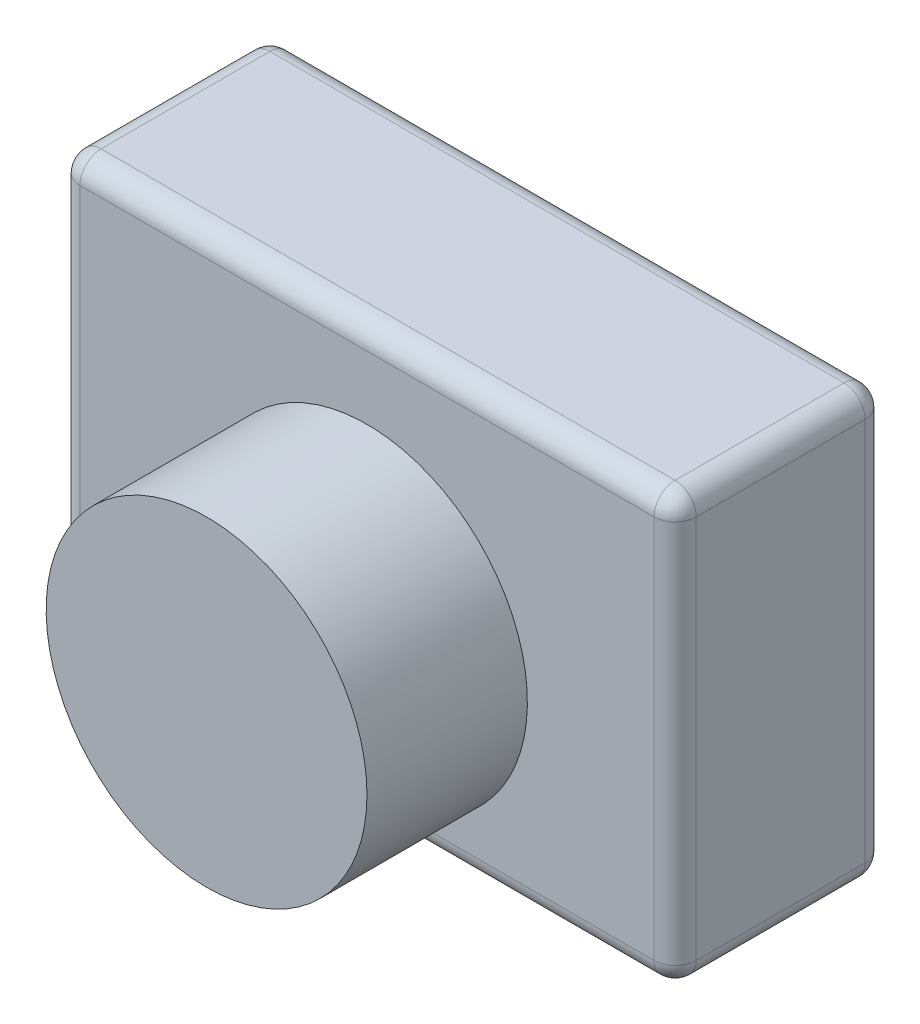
ISO-10303-21;
HEADER;
FILE_DESCRIPTION(('STEP AP214'),'2;1');
FILE_NAME('part.step','',(''),(''),'','','');
FILE_SCHEMA(('AUTOMOTIVE_DESIGN { 1 0 10303 214 1 1 1 1 }'));
ENDSEC;
DATA;
#1=APPLICATION_CONTEXT('core data for automotive mechanical design processes');
#2=APPLICATION_PROTOCOL_DEFINITION('international standard','automotive_design',2000,#1);
#3=PRODUCT_CONTEXT('',#1,'mechanical');
#4=PRODUCT('Part','Part','',(#3));
#5=PRODUCT_RELATED_PRODUCT_CATEGORY('part','',(#4));
#6=PRODUCT_DEFINITION_FORMATION('','',#4);
#7=PRODUCT_DEFINITION_CONTEXT('part definition',#1,'design');
#8=PRODUCT_DEFINITION('design','',#6,#7);
#9=PRODUCT_DEFINITION_SHAPE('','',#8);
#10=(LENGTH_UNIT() NAMED_UNIT(*) SI_UNIT(.MILLI.,.METRE.));
#11=(NAMED_UNIT(*) PLANE_ANGLE_UNIT() SI_UNIT($,.RADIAN.));
#12=(NAMED_UNIT(*) SI_UNIT($,.STERADIAN.) SOLID_ANGLE_UNIT());
#13=UNCERTAINTY_MEASURE_WITH_UNIT(LENGTH_MEASURE(1.E-05),#10,'distance_accuracy_value','');
#14=(GEOMETRIC_REPRESENTATION_CONTEXT(3) GLOBAL_UNCERTAINTY_ASSIGNED_CONTEXT((#13)) GLOBAL_UNIT_ASSIGNED_CONTEXT((#10,
#11,#12)) REPRESENTATION_CONTEXT('',''));
#15=CARTESIAN_POINT('',(0.,0.,0.));
#16=DIRECTION('',(0.,0.,1.));
#17=DIRECTION('',(1.,0.,0.));
#18=AXIS2_PLACEMENT_3D('',#15,#16,#17);
#19=CARTESIAN_POINT('',(-20.3950532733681,-82.7621158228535,50.));
#20=DIRECTION('',(0.,0.,1.));
#21=DIRECTION('',(1.,0.,0.));
#22=AXIS2_PLACEMENT_3D('',#19,#20,#21);
#23=PLANE('',#22);
#24=DIRECTION('',(1.,0.,0.));
#25=VECTOR('',#24,1.);
#26=CARTESIAN_POINT('',(125.604946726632,-77.7621158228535,50.));
#27=LINE('',#26,#25);
#28=CARTESIAN_POINT('',(-15.3950532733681,-77.7621158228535,50.));
#29=VERTEX_POINT('',#28);
#30=CARTESIAN_POINT('',(52.6049467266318,-77.7621158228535,50.));
#31=VERTEX_POINT('',#30);
#32=EDGE_CURVE('E157',#29,#31,#27,.T.);
#33=ORIENTED_EDGE('',*,*,#32,.T.);
#34=CARTESIAN_POINT('',(52.6049467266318,-39.7621158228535,50.));
#35=DIRECTION('',(0.,0.,1.));
#36=DIRECTION('',(1.,0.,0.));
#37=AXIS2_PLACEMENT_3D('',#34,#35,#36);
#38=CIRCLE('',#37,38.);
#39=EDGE_CURVE('E50',#31,#31,#38,.T.);
#40=ORIENTED_EDGE('',*,*,#39,.F.);
#41=CARTESIAN_POINT('',(120.604946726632,-77.7621158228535,50.));
#42=VERTEX_POINT('',#41);
#43=EDGE_CURVE('E161',#31,#42,#27,.T.);
#44=ORIENTED_EDGE('',*,*,#43,.T.);
#45=DIRECTION('',(0.,1.,0.));
#46=VECTOR('',#45,1.);
#47=CARTESIAN_POINT('',(120.604946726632,18.2378841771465,50.));
#48=LINE('',#47,#46);
#49=CARTESIAN_POINT('',(120.604946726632,13.2378841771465,50.));
#50=VERTEX_POINT('',#49);
#51=EDGE_CURVE('E163',#42,#50,#48,.T.);
#52=ORIENTED_EDGE('',*,*,#51,.T.);
#53=DIRECTION('',(-1.,0.,0.));
#54=VECTOR('',#53,1.);
#55=CARTESIAN_POINT('',(-20.3950532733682,13.2378841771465,50.));
#56=LINE('',#55,#54);
#57=CARTESIAN_POINT('',(-15.3950532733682,13.2378841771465,50.));
#58=VERTEX_POINT('',#57);
#59=EDGE_CURVE('E166',#50,#58,#56,.T.);
#60=ORIENTED_EDGE('',*,*,#59,.T.);
#61=DIRECTION('',(0.,-1.,0.));
#62=VECTOR('',#61,1.);
#63=CARTESIAN_POINT('',(-15.3950532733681,-82.7621158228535,50.));
#64=LINE('',#63,#62);
#65=EDGE_CURVE('E160',#58,#29,#64,.T.);
#66=ORIENTED_EDGE('',*,*,#65,.T.);
#67=EDGE_LOOP('',(#33,#40,#44,#52,#60,#66));
#68=FACE_BOUND('',#67,.T.);
#69=ADVANCED_FACE('F35',(#68),#23,.T.);
#70=CARTESIAN_POINT('',(-20.3950532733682,18.2378841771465,50.));
#71=DIRECTION('',(1.,0.,0.));
#72=DIRECTION('',(0.,1.,0.));
#73=AXIS2_PLACEMENT_3D('',#70,#71,#72);
#74=PLANE('',#73);
#75=DIRECTION('',(0.,0.,-1.));
#76=VECTOR('',#75,1.);
#77=CARTESIAN_POINT('',(-20.3950532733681,-77.7621158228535,50.));
#78=LINE('',#77,#76);
#79=CARTESIAN_POINT('',(-20.3950532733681,-77.7621158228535,5.));
#80=VERTEX_POINT('',#79);
#81=CARTESIAN_POINT('',(-20.3950532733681,-77.7621158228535,45.));
#82=VERTEX_POINT('',#81);
#83=EDGE_CURVE('E177',#80,#82,#78,.F.);
#84=ORIENTED_EDGE('',*,*,#83,.T.);
#85=DIRECTION('',(0.,-1.,0.));
#86=VECTOR('',#85,1.);
#87=CARTESIAN_POINT('',(-20.3950532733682,18.2378841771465,45.));
#88=LINE('',#87,#86);
#89=CARTESIAN_POINT('',(-20.3950532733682,13.2378841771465,45.));
#90=VERTEX_POINT('',#89);
#91=EDGE_CURVE('E183',#82,#90,#88,.F.);
#92=ORIENTED_EDGE('',*,*,#91,.T.);
#93=DIRECTION('',(0.,0.,-1.));
#94=VECTOR('',#93,1.);
#95=CARTESIAN_POINT('',(-20.3950532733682,13.2378841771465,50.));
#96=LINE('',#95,#94);
#97=CARTESIAN_POINT('',(-20.3950532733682,13.2378841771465,5.));
#98=VERTEX_POINT('',#97);
#99=EDGE_CURVE('E181',#90,#98,#96,.T.);
#100=ORIENTED_EDGE('',*,*,#99,.T.);
#101=DIRECTION('',(0.,-1.,0.));
#102=VECTOR('',#101,1.);
#103=CARTESIAN_POINT('',(-20.3950532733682,18.2378841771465,5.));
#104=LINE('',#103,#102);
#105=EDGE_CURVE('E179',#98,#80,#104,.T.);
#106=ORIENTED_EDGE('',*,*,#105,.T.);
#107=EDGE_LOOP('',(#84,#92,#100,#106));
#108=FACE_BOUND('',#107,.T.);
#109=ADVANCED_FACE('F320',(#108),#74,.F.);
#110=CARTESIAN_POINT('',(-20.3950532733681,-82.7621158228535,50.));
#111=DIRECTION('',(0.,1.,0.));
#112=DIRECTION('',(0.,0.,1.));
#113=AXIS2_PLACEMENT_3D('',#110,#111,#112);
#114=PLANE('',#113);
#115=CARTESIAN_POINT('',(24.,-82.7621158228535,25.));
#116=DIRECTION('',(0.,-1.,0.));
#117=DIRECTION('',(0.,0.,-1.));
#118=AXIS2_PLACEMENT_3D('',#115,#116,#117);
#119=CIRCLE('',#118,1.89864999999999);
#120=CARTESIAN_POINT('',(24.,-82.7621158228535,23.10135));
#121=VERTEX_POINT('',#120);
#122=EDGE_CURVE('E142',#121,#121,#119,.T.);
#123=ORIENTED_EDGE('',*,*,#122,.F.);
#124=EDGE_LOOP('',(#123));
#125=FACE_BOUND('',#124,.T.);
#126=CARTESIAN_POINT('',(74.,-82.7621158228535,25.));
#127=DIRECTION('',(0.,-1.,0.));
#128=DIRECTION('',(0.,0.,-1.));
#129=AXIS2_PLACEMENT_3D('',#126,#127,#128);
#130=CIRCLE('',#129,1.89864999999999);
#131=CARTESIAN_POINT('',(74.,-82.7621158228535,23.10135));
#132=VERTEX_POINT('',#131);
#133=EDGE_CURVE('E141',#132,#132,#130,.T.);
#134=ORIENTED_EDGE('',*,*,#133,.F.);
#135=EDGE_LOOP('',(#134));
#136=FACE_BOUND('',#135,.T.);
#137=DIRECTION('',(1.,0.,0.));
#138=VECTOR('',#137,1.);
#139=CARTESIAN_POINT('',(-20.3950532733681,-82.7621158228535,45.));
#140=LINE('',#139,#138);
#141=CARTESIAN_POINT('',(120.604946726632,-82.7621158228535,45.));
#142=VERTEX_POINT('',#141);
#143=CARTESIAN_POINT('',(-15.3950532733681,-82.7621158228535,45.));
#144=VERTEX_POINT('',#143);
#145=EDGE_CURVE('E44',#142,#144,#140,.F.);
#146=ORIENTED_EDGE('',*,*,#145,.T.);
#147=DIRECTION('',(0.,0.,-1.));
#148=VECTOR('',#147,1.);
#149=CARTESIAN_POINT('',(-15.3950532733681,-82.7621158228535,50.));
#150=LINE('',#149,#148);
#151=CARTESIAN_POINT('',(-15.3950532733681,-82.7621158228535,5.));
#152=VERTEX_POINT('',#151);
#153=EDGE_CURVE('E11',#144,#152,#150,.T.);
#154=ORIENTED_EDGE('',*,*,#153,.T.);
#155=DIRECTION('',(1.,0.,0.));
#156=VECTOR('',#155,1.);
#157=CARTESIAN_POINT('',(-20.3950532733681,-82.7621158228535,5.));
#158=LINE('',#157,#156);
#159=CARTESIAN_POINT('',(120.604946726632,-82.7621158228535,5.));
#160=VERTEX_POINT('',#159);
#161=EDGE_CURVE('E204',#152,#160,#158,.T.);
#162=ORIENTED_EDGE('',*,*,#161,.T.);
#163=DIRECTION('',(0.,0.,-1.));
#164=VECTOR('',#163,1.);
#165=CARTESIAN_POINT('',(120.604946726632,-82.7621158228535,50.));
#166=LINE('',#165,#164);
#167=EDGE_CURVE('E206',#160,#142,#166,.F.);
#168=ORIENTED_EDGE('',*,*,#167,.T.);
#169=EDGE_LOOP('',(#146,#154,#162,#168));
#170=FACE_BOUND('',#169,.T.);
#171=ADVANCED_FACE('F344',(#125,#136,#170),#114,.F.);
#172=CARTESIAN_POINT('',(125.604946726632,18.2378841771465,50.));
#173=DIRECTION('',(-1.,0.,0.));
#174=DIRECTION('',(0.,0.,1.));
#175=AXIS2_PLACEMENT_3D('',#172,#173,#174);
#176=PLANE('',#175);
#177=DIRECTION('',(0.,0.,-1.));
#178=VECTOR('',#177,1.);
#179=CARTESIAN_POINT('',(125.604946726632,13.2378841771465,50.));
#180=LINE('',#179,#178);
#181=CARTESIAN_POINT('',(125.604946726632,13.2378841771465,5.));
#182=VERTEX_POINT('',#181);
#183=CARTESIAN_POINT('',(125.604946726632,13.2378841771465,45.));
#184=VERTEX_POINT('',#183);
#185=EDGE_CURVE('E172',#182,#184,#180,.F.);
#186=ORIENTED_EDGE('',*,*,#185,.T.);
#187=DIRECTION('',(0.,1.,0.));
#188=VECTOR('',#187,1.);
#189=CARTESIAN_POINT('',(125.604946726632,-82.7621158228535,45.));
#190=LINE('',#189,#188);
#191=CARTESIAN_POINT('',(125.604946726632,-77.7621158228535,45.));
#192=VERTEX_POINT('',#191);
#193=EDGE_CURVE('E174',#184,#192,#190,.F.);
#194=ORIENTED_EDGE('',*,*,#193,.T.);
#195=DIRECTION('',(0.,0.,-1.));
#196=VECTOR('',#195,1.);
#197=CARTESIAN_POINT('',(125.604946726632,-77.7621158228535,50.));
#198=LINE('',#197,#196);
#199=CARTESIAN_POINT('',(125.604946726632,-77.7621158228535,5.));
#200=VERTEX_POINT('',#199);
#201=EDGE_CURVE('E168',#192,#200,#198,.T.);
#202=ORIENTED_EDGE('',*,*,#201,.T.);
#203=DIRECTION('',(0.,1.,0.));
#204=VECTOR('',#203,1.);
#205=CARTESIAN_POINT('',(125.604946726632,18.2378841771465,5.));
#206=LINE('',#205,#204);
#207=EDGE_CURVE('E170',#200,#182,#206,.T.);
#208=ORIENTED_EDGE('',*,*,#207,.T.);
#209=EDGE_LOOP('',(#186,#194,#202,#208));
#210=FACE_BOUND('',#209,.T.);
#211=ADVANCED_FACE('F357',(#210),#176,.F.);
#212=CARTESIAN_POINT('',(-20.3950532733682,18.2378841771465,50.));
#213=DIRECTION('',(0.,-1.,0.));
#214=DIRECTION('',(0.,0.,-1.));
#215=AXIS2_PLACEMENT_3D('',#212,#213,#214);
#216=PLANE('',#215);
#217=DIRECTION('',(-1.,0.,0.));
#218=VECTOR('',#217,1.);
#219=CARTESIAN_POINT('',(125.604946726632,18.2378841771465,45.));
#220=LINE('',#219,#218);
#221=CARTESIAN_POINT('',(-15.3950532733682,18.2378841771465,45.));
#222=VERTEX_POINT('',#221);
#223=CARTESIAN_POINT('',(120.604946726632,18.2378841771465,45.));
#224=VERTEX_POINT('',#223);
#225=EDGE_CURVE('E190',#222,#224,#220,.F.);
#226=ORIENTED_EDGE('',*,*,#225,.T.);
#227=DIRECTION('',(0.,0.,-1.));
#228=VECTOR('',#227,1.);
#229=CARTESIAN_POINT('',(120.604946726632,18.2378841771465,50.));
#230=LINE('',#229,#228);
#231=CARTESIAN_POINT('',(120.604946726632,18.2378841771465,5.));
#232=VERTEX_POINT('',#231);
#233=EDGE_CURVE('E192',#224,#232,#230,.T.);
#234=ORIENTED_EDGE('',*,*,#233,.T.);
#235=DIRECTION('',(-1.,0.,0.));
#236=VECTOR('',#235,1.);
#237=CARTESIAN_POINT('',(-20.3950532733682,18.2378841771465,5.));
#238=LINE('',#237,#236);
#239=CARTESIAN_POINT('',(-15.3950532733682,18.2378841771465,5.));
#240=VERTEX_POINT('',#239);
#241=EDGE_CURVE('E186',#232,#240,#238,.T.);
#242=ORIENTED_EDGE('',*,*,#241,.T.);
#243=DIRECTION('',(0.,0.,-1.));
#244=VECTOR('',#243,1.);
#245=CARTESIAN_POINT('',(-15.3950532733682,18.2378841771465,50.));
#246=LINE('',#245,#244);
#247=EDGE_CURVE('E188',#240,#222,#246,.F.);
#248=ORIENTED_EDGE('',*,*,#247,.T.);
#249=EDGE_LOOP('',(#226,#234,#242,#248));
#250=FACE_BOUND('',#249,.T.);
#251=ADVANCED_FACE('F353',(#250),#216,.F.);
#252=CARTESIAN_POINT('',(-20.3950532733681,-82.7621158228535,0.));
#253=DIRECTION('',(0.,0.,1.));
#254=DIRECTION('',(1.,0.,0.));
#255=AXIS2_PLACEMENT_3D('',#252,#253,#254);
#256=PLANE('',#255);
#257=DIRECTION('',(-1.,0.,0.));
#258=VECTOR('',#257,1.);
#259=CARTESIAN_POINT('',(-20.3950532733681,13.2378841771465,0.));
#260=LINE('',#259,#258);
#261=CARTESIAN_POINT('',(-15.3950532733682,13.2378841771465,0.));
#262=VERTEX_POINT('',#261);
#263=CARTESIAN_POINT('',(120.604946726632,13.2378841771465,0.));
#264=VERTEX_POINT('',#263);
#265=EDGE_CURVE('E199',#262,#264,#260,.F.);
#266=ORIENTED_EDGE('',*,*,#265,.T.);
#267=DIRECTION('',(0.,1.,0.));
#268=VECTOR('',#267,1.);
#269=CARTESIAN_POINT('',(120.604946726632,-82.7621158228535,0.));
#270=LINE('',#269,#268);
#271=CARTESIAN_POINT('',(120.604946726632,-77.7621158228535,0.));
#272=VERTEX_POINT('',#271);
#273=EDGE_CURVE('E201',#264,#272,#270,.F.);
#274=ORIENTED_EDGE('',*,*,#273,.T.);
#275=DIRECTION('',(1.,0.,0.));
#276=VECTOR('',#275,1.);
#277=CARTESIAN_POINT('',(-20.3950532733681,-77.7621158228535,0.));
#278=LINE('',#277,#276);
#279=CARTESIAN_POINT('',(-15.3950532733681,-77.7621158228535,0.));
#280=VERTEX_POINT('',#279);
#281=EDGE_CURVE('E195',#272,#280,#278,.F.);
#282=ORIENTED_EDGE('',*,*,#281,.T.);
#283=DIRECTION('',(0.,-1.,0.));
#284=VECTOR('',#283,1.);
#285=CARTESIAN_POINT('',(-15.3950532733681,-82.7621158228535,0.));
#286=LINE('',#285,#284);
#287=EDGE_CURVE('E197',#280,#262,#286,.F.);
#288=ORIENTED_EDGE('',*,*,#287,.T.);
#289=EDGE_LOOP('',(#266,#274,#282,#288));
#290=FACE_BOUND('',#289,.T.);
#291=ADVANCED_FACE('F350',(#290),#256,.F.);
#292=CARTESIAN_POINT('',(-15.3950532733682,18.2378841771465,5.));
#293=DIRECTION('',(0.,-1.,0.));
#294=DIRECTION('',(1.,0.,0.));
#295=AXIS2_PLACEMENT_3D('',#292,#293,#294);
#296=CYLINDRICAL_SURFACE('',#295,5.);
#297=CARTESIAN_POINT('',(-15.3950532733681,-77.7621158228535,5.));
#298=DIRECTION('',(0.,-1.,0.));
#299=DIRECTION('',(0.,0.,-1.));
#300=AXIS2_PLACEMENT_3D('',#297,#298,#299);
#301=CIRCLE('',#300,5.);
#302=EDGE_CURVE('E39',#80,#280,#301,.T.);
#303=ORIENTED_EDGE('',*,*,#302,.F.);
#304=ORIENTED_EDGE('',*,*,#105,.F.);
#305=CARTESIAN_POINT('',(-15.3950532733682,13.2378841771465,5.));
#306=DIRECTION('',(0.,1.,0.));
#307=DIRECTION('',(0.,0.,1.));
#308=AXIS2_PLACEMENT_3D('',#305,#306,#307);
#309=CIRCLE('',#308,5.);
#310=EDGE_CURVE('E268',#262,#98,#309,.T.);
#311=ORIENTED_EDGE('',*,*,#310,.F.);
#312=ORIENTED_EDGE('',*,*,#287,.F.);
#313=EDGE_LOOP('',(#303,#304,#311,#312));
#314=FACE_BOUND('',#313,.T.);
#315=ADVANCED_FACE('F37',(#314),#296,.T.);
#316=CARTESIAN_POINT('',(-15.3950532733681,-77.7621158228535,5.));
#317=DIRECTION('',(0.,0.,1.));
#318=DIRECTION('',(1.,0.,0.));
#319=AXIS2_PLACEMENT_3D('',#316,#317,#318);
#320=SPHERICAL_SURFACE('',#319,5.);
#321=CARTESIAN_POINT('',(-15.3950532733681,-77.7621158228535,5.));
#322=DIRECTION('',(0.,0.,-1.));
#323=DIRECTION('',(-1.,0.,0.));
#324=AXIS2_PLACEMENT_3D('',#321,#322,#323);
#325=CIRCLE('',#324,5.);
#326=EDGE_CURVE('E263',#80,#152,#325,.F.);
#327=ORIENTED_EDGE('',*,*,#326,.F.);
#328=ORIENTED_EDGE('',*,*,#302,.T.);
#329=CARTESIAN_POINT('',(-15.3950532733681,-77.7621158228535,5.));
#330=DIRECTION('',(-1.,0.,0.));
#331=DIRECTION('',(0.,0.,1.));
#332=AXIS2_PLACEMENT_3D('',#329,#330,#331);
#333=CIRCLE('',#332,5.);
#334=EDGE_CURVE('E266',#152,#280,#333,.F.);
#335=ORIENTED_EDGE('',*,*,#334,.F.);
#336=EDGE_LOOP('',(#327,#328,#335));
#337=FACE_BOUND('',#336,.T.);
#338=ADVANCED_FACE('F410',(#337),#320,.T.);
#339=CARTESIAN_POINT('',(-15.3950532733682,13.2378841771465,5.));
#340=DIRECTION('',(0.,0.,1.));
#341=DIRECTION('',(1.,0.,0.));
#342=AXIS2_PLACEMENT_3D('',#339,#340,#341);
#343=SPHERICAL_SURFACE('',#342,5.);
#344=CARTESIAN_POINT('',(-15.3950532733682,13.2378841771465,5.));
#345=DIRECTION('',(-1.,0.,0.));
#346=DIRECTION('',(0.,0.,1.));
#347=AXIS2_PLACEMENT_3D('',#344,#345,#346);
#348=CIRCLE('',#347,5.);
#349=EDGE_CURVE('E257',#262,#240,#348,.F.);
#350=ORIENTED_EDGE('',*,*,#349,.F.);
#351=ORIENTED_EDGE('',*,*,#310,.T.);
#352=CARTESIAN_POINT('',(-15.3950532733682,13.2378841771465,5.));
#353=DIRECTION('',(0.,0.,-1.));
#354=DIRECTION('',(-1.,0.,0.));
#355=AXIS2_PLACEMENT_3D('',#352,#353,#354);
#356=CIRCLE('',#355,5.);
#357=EDGE_CURVE('E260',#240,#98,#356,.F.);
#358=ORIENTED_EDGE('',*,*,#357,.F.);
#359=EDGE_LOOP('',(#350,#351,#358));
#360=FACE_BOUND('',#359,.T.);
#361=ADVANCED_FACE('F408',(#360),#343,.T.);
#362=CARTESIAN_POINT('',(-20.3950532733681,-77.7621158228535,5.));
#363=DIRECTION('',(1.,0.,0.));
#364=DIRECTION('',(0.,0.,-1.));
#365=AXIS2_PLACEMENT_3D('',#362,#363,#364);
#366=CYLINDRICAL_SURFACE('',#365,5.);
#367=ORIENTED_EDGE('',*,*,#334,.T.);
#368=ORIENTED_EDGE('',*,*,#281,.F.);
#369=CARTESIAN_POINT('',(120.604946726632,-77.7621158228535,5.));
#370=DIRECTION('',(1.,0.,0.));
#371=DIRECTION('',(0.,0.,-1.));
#372=AXIS2_PLACEMENT_3D('',#369,#370,#371);
#373=CIRCLE('',#372,5.);
#374=EDGE_CURVE('E252',#160,#272,#373,.T.);
#375=ORIENTED_EDGE('',*,*,#374,.F.);
#376=ORIENTED_EDGE('',*,*,#161,.F.);
#377=EDGE_LOOP('',(#367,#368,#375,#376));
#378=FACE_BOUND('',#377,.T.);
#379=ADVANCED_FACE('F405',(#378),#366,.T.);
#380=CARTESIAN_POINT('',(-15.3950532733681,-77.7621158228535,50.));
#381=DIRECTION('',(0.,0.,-1.));
#382=DIRECTION('',(-1.,0.,0.));
#383=AXIS2_PLACEMENT_3D('',#380,#381,#382);
#384=CYLINDRICAL_SURFACE('',#383,5.);
#385=ORIENTED_EDGE('',*,*,#326,.T.);
#386=ORIENTED_EDGE('',*,*,#153,.F.);
#387=CARTESIAN_POINT('',(-15.3950532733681,-77.7621158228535,45.));
#388=DIRECTION('',(0.,0.,1.));
#389=DIRECTION('',(1.,0.,0.));
#390=AXIS2_PLACEMENT_3D('',#387,#388,#389);
#391=CIRCLE('',#390,5.);
#392=EDGE_CURVE('E249',#82,#144,#391,.T.);
#393=ORIENTED_EDGE('',*,*,#392,.F.);
#394=ORIENTED_EDGE('',*,*,#83,.F.);
#395=EDGE_LOOP('',(#385,#386,#393,#394));
#396=FACE_BOUND('',#395,.T.);
#397=ADVANCED_FACE('F324',(#396),#384,.T.);
#398=CARTESIAN_POINT('',(-15.3950532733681,-82.7621158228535,45.));
#399=DIRECTION('',(0.,1.,0.));
#400=DIRECTION('',(-1.,0.,0.));
#401=AXIS2_PLACEMENT_3D('',#398,#399,#400);
#402=CYLINDRICAL_SURFACE('',#401,5.);
#403=CARTESIAN_POINT('',(-15.3950532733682,13.2378841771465,45.));
#404=DIRECTION('',(0.,1.,0.));
#405=DIRECTION('',(0.,0.,1.));
#406=AXIS2_PLACEMENT_3D('',#403,#404,#405);
#407=CIRCLE('',#406,5.);
#408=EDGE_CURVE('E243',#90,#58,#407,.T.);
#409=ORIENTED_EDGE('',*,*,#408,.F.);
#410=ORIENTED_EDGE('',*,*,#91,.F.);
#411=CARTESIAN_POINT('',(-15.3950532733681,-77.7621158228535,45.));
#412=DIRECTION('',(0.,-1.,0.));
#413=DIRECTION('',(0.,0.,-1.));
#414=AXIS2_PLACEMENT_3D('',#411,#412,#413);
#415=CIRCLE('',#414,5.);
#416=EDGE_CURVE('E246',#29,#82,#415,.T.);
#417=ORIENTED_EDGE('',*,*,#416,.F.);
#418=ORIENTED_EDGE('',*,*,#65,.F.);
#419=EDGE_LOOP('',(#409,#410,#417,#418));
#420=FACE_BOUND('',#419,.T.);
#421=ADVANCED_FACE('F308',(#420),#402,.T.);
#422=CARTESIAN_POINT('',(-15.3950532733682,13.2378841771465,50.));
#423=DIRECTION('',(0.,0.,-1.));
#424=DIRECTION('',(-1.,0.,0.));
#425=AXIS2_PLACEMENT_3D('',#422,#423,#424);
#426=CYLINDRICAL_SURFACE('',#425,5.);
#427=ORIENTED_EDGE('',*,*,#357,.T.);
#428=ORIENTED_EDGE('',*,*,#99,.F.);
#429=CARTESIAN_POINT('',(-15.3950532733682,13.2378841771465,45.));
#430=DIRECTION('',(0.,0.,1.));
#431=DIRECTION('',(1.,0.,0.));
#432=AXIS2_PLACEMENT_3D('',#429,#430,#431);
#433=CIRCLE('',#432,5.);
#434=EDGE_CURVE('E241',#222,#90,#433,.T.);
#435=ORIENTED_EDGE('',*,*,#434,.F.);
#436=ORIENTED_EDGE('',*,*,#247,.F.);
#437=EDGE_LOOP('',(#427,#428,#435,#436));
#438=FACE_BOUND('',#437,.T.);
#439=ADVANCED_FACE('F317',(#438),#426,.T.);
#440=CARTESIAN_POINT('',(-20.3950532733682,13.2378841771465,5.));
#441=DIRECTION('',(-1.,0.,0.));
#442=DIRECTION('',(0.,0.,1.));
#443=AXIS2_PLACEMENT_3D('',#440,#441,#442);
#444=CYLINDRICAL_SURFACE('',#443,5.);
#445=ORIENTED_EDGE('',*,*,#349,.T.);
#446=ORIENTED_EDGE('',*,*,#241,.F.);
#447=CARTESIAN_POINT('',(120.604946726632,13.2378841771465,5.));
#448=DIRECTION('',(1.,0.,0.));
#449=DIRECTION('',(0.,0.,-1.));
#450=AXIS2_PLACEMENT_3D('',#447,#448,#449);
#451=CIRCLE('',#450,5.);
#452=EDGE_CURVE('E238',#264,#232,#451,.T.);
#453=ORIENTED_EDGE('',*,*,#452,.F.);
#454=ORIENTED_EDGE('',*,*,#265,.F.);
#455=EDGE_LOOP('',(#445,#446,#453,#454));
#456=FACE_BOUND('',#455,.T.);
#457=ADVANCED_FACE('F399',(#456),#444,.T.);
#458=CARTESIAN_POINT('',(120.604946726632,18.2378841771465,5.));
#459=DIRECTION('',(0.,1.,0.));
#460=DIRECTION('',(0.,0.,1.));
#461=AXIS2_PLACEMENT_3D('',#458,#459,#460);
#462=CYLINDRICAL_SURFACE('',#461,5.);
#463=CARTESIAN_POINT('',(120.604946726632,-77.7621158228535,5.));
#464=DIRECTION('',(0.,-1.,0.));
#465=DIRECTION('',(0.,0.,-1.));
#466=AXIS2_PLACEMENT_3D('',#463,#464,#465);
#467=CIRCLE('',#466,5.);
#468=EDGE_CURVE('E254',#272,#200,#467,.T.);
#469=ORIENTED_EDGE('',*,*,#468,.F.);
#470=ORIENTED_EDGE('',*,*,#273,.F.);
#471=CARTESIAN_POINT('',(120.604946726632,13.2378841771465,5.));
#472=DIRECTION('',(0.,1.,0.));
#473=DIRECTION('',(0.,0.,1.));
#474=AXIS2_PLACEMENT_3D('',#471,#472,#473);
#475=CIRCLE('',#474,5.);
#476=EDGE_CURVE('E235',#182,#264,#475,.T.);
#477=ORIENTED_EDGE('',*,*,#476,.F.);
#478=ORIENTED_EDGE('',*,*,#207,.F.);
#479=EDGE_LOOP('',(#469,#470,#477,#478));
#480=FACE_BOUND('',#479,.T.);
#481=ADVANCED_FACE('F336',(#480),#462,.T.);
#482=CARTESIAN_POINT('',(120.604946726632,-77.7621158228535,5.));
#483=DIRECTION('',(0.,0.,1.));
#484=DIRECTION('',(1.,0.,0.));
#485=AXIS2_PLACEMENT_3D('',#482,#483,#484);
#486=SPHERICAL_SURFACE('',#485,5.);
#487=ORIENTED_EDGE('',*,*,#374,.T.);
#488=ORIENTED_EDGE('',*,*,#468,.T.);
#489=CARTESIAN_POINT('',(120.604946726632,-77.7621158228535,5.));
#490=DIRECTION('',(0.,0.,-1.));
#491=DIRECTION('',(-1.,0.,0.));
#492=AXIS2_PLACEMENT_3D('',#489,#490,#491);
#493=CIRCLE('',#492,5.);
#494=EDGE_CURVE('E232',#160,#200,#493,.F.);
#495=ORIENTED_EDGE('',*,*,#494,.F.);
#496=EDGE_LOOP('',(#487,#488,#495));
#497=FACE_BOUND('',#496,.T.);
#498=ADVANCED_FACE('F328',(#497),#486,.T.);
#499=CARTESIAN_POINT('',(-15.3950532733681,-77.7621158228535,45.));
#500=DIRECTION('',(0.,0.,1.));
#501=DIRECTION('',(1.,0.,0.));
#502=AXIS2_PLACEMENT_3D('',#499,#500,#501);
#503=SPHERICAL_SURFACE('',#502,5.);
#504=ORIENTED_EDGE('',*,*,#416,.T.);
#505=ORIENTED_EDGE('',*,*,#392,.T.);
#506=CARTESIAN_POINT('',(-15.3950532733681,-77.7621158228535,45.));
#507=DIRECTION('',(-1.,0.,0.));
#508=DIRECTION('',(0.,0.,1.));
#509=AXIS2_PLACEMENT_3D('',#506,#507,#508);
#510=CIRCLE('',#509,5.);
#511=EDGE_CURVE('E229',#29,#144,#510,.F.);
#512=ORIENTED_EDGE('',*,*,#511,.F.);
#513=EDGE_LOOP('',(#504,#505,#512));
#514=FACE_BOUND('',#513,.T.);
#515=ADVANCED_FACE('F326',(#514),#503,.T.);
#516=CARTESIAN_POINT('',(-15.3950532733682,13.2378841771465,45.));
#517=DIRECTION('',(0.,0.,1.));
#518=DIRECTION('',(1.,0.,0.));
#519=AXIS2_PLACEMENT_3D('',#516,#517,#518);
#520=SPHERICAL_SURFACE('',#519,5.);
#521=ORIENTED_EDGE('',*,*,#434,.T.);
#522=ORIENTED_EDGE('',*,*,#408,.T.);
#523=CARTESIAN_POINT('',(-15.3950532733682,13.2378841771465,45.));
#524=DIRECTION('',(-1.,0.,0.));
#525=DIRECTION('',(0.,0.,1.));
#526=AXIS2_PLACEMENT_3D('',#523,#524,#525);
#527=CIRCLE('',#526,5.);
#528=EDGE_CURVE('E226',#222,#58,#527,.F.);
#529=ORIENTED_EDGE('',*,*,#528,.F.);
#530=EDGE_LOOP('',(#521,#522,#529));
#531=FACE_BOUND('',#530,.T.);
#532=ADVANCED_FACE('F313',(#531),#520,.T.);
#533=CARTESIAN_POINT('',(120.604946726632,13.2378841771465,5.));
#534=DIRECTION('',(0.,0.,1.));
#535=DIRECTION('',(1.,0.,0.));
#536=AXIS2_PLACEMENT_3D('',#533,#534,#535);
#537=SPHERICAL_SURFACE('',#536,5.);
#538=ORIENTED_EDGE('',*,*,#476,.T.);
#539=ORIENTED_EDGE('',*,*,#452,.T.);
#540=CARTESIAN_POINT('',(120.604946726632,13.2378841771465,5.));
#541=DIRECTION('',(0.,0.,-1.));
#542=DIRECTION('',(-1.,0.,0.));
#543=AXIS2_PLACEMENT_3D('',#540,#541,#542);
#544=CIRCLE('',#543,5.);
#545=EDGE_CURVE('E224',#182,#232,#544,.F.);
#546=ORIENTED_EDGE('',*,*,#545,.F.);
#547=EDGE_LOOP('',(#538,#539,#546));
#548=FACE_BOUND('',#547,.T.);
#549=ADVANCED_FACE('F334',(#548),#537,.T.);
#550=CARTESIAN_POINT('',(120.604946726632,-77.7621158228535,50.));
#551=DIRECTION('',(0.,0.,-1.));
#552=DIRECTION('',(-1.,0.,0.));
#553=AXIS2_PLACEMENT_3D('',#550,#551,#552);
#554=CYLINDRICAL_SURFACE('',#553,5.);
#555=ORIENTED_EDGE('',*,*,#494,.T.);
#556=ORIENTED_EDGE('',*,*,#201,.F.);
#557=CARTESIAN_POINT('',(120.604946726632,-77.7621158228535,45.));
#558=DIRECTION('',(0.,0.,1.));
#559=DIRECTION('',(1.,0.,0.));
#560=AXIS2_PLACEMENT_3D('',#557,#558,#559);
#561=CIRCLE('',#560,5.);
#562=EDGE_CURVE('E221',#142,#192,#561,.T.);
#563=ORIENTED_EDGE('',*,*,#562,.F.);
#564=ORIENTED_EDGE('',*,*,#167,.F.);
#565=EDGE_LOOP('',(#555,#556,#563,#564));
#566=FACE_BOUND('',#565,.T.);
#567=ADVANCED_FACE('F379',(#566),#554,.T.);
#568=CARTESIAN_POINT('',(-20.3950532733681,-77.7621158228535,45.));
#569=DIRECTION('',(-1.,0.,0.));
#570=DIRECTION('',(0.,0.,1.));
#571=AXIS2_PLACEMENT_3D('',#568,#569,#570);
#572=CYLINDRICAL_SURFACE('',#571,5.);
#573=ORIENTED_EDGE('',*,*,#511,.T.);
#574=ORIENTED_EDGE('',*,*,#145,.F.);
#575=CARTESIAN_POINT('',(120.604946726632,-77.7621158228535,45.));
#576=DIRECTION('',(1.,0.,0.));
#577=DIRECTION('',(0.,1.,0.));
#578=AXIS2_PLACEMENT_3D('',#575,#576,#577);
#579=CIRCLE('',#578,5.);
#580=EDGE_CURVE('E218',#42,#142,#579,.T.);
#581=ORIENTED_EDGE('',*,*,#580,.F.);
#582=ORIENTED_EDGE('',*,*,#43,.F.);
#583=ORIENTED_EDGE('',*,*,#32,.F.);
#584=EDGE_LOOP('',(#573,#574,#581,#582,#583));
#585=FACE_BOUND('',#584,.T.);
#586=ADVANCED_FACE('F286',(#585),#572,.T.);
#587=CARTESIAN_POINT('',(-20.3950532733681,13.2378841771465,45.));
#588=DIRECTION('',(1.,0.,0.));
#589=DIRECTION('',(0.,0.,-1.));
#590=AXIS2_PLACEMENT_3D('',#587,#588,#589);
#591=CYLINDRICAL_SURFACE('',#590,5.);
#592=ORIENTED_EDGE('',*,*,#528,.T.);
#593=ORIENTED_EDGE('',*,*,#59,.F.);
#594=CARTESIAN_POINT('',(120.604946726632,13.2378841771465,45.));
#595=DIRECTION('',(1.,0.,0.));
#596=DIRECTION('',(0.,0.,-1.));
#597=AXIS2_PLACEMENT_3D('',#594,#595,#596);
#598=CIRCLE('',#597,5.);
#599=EDGE_CURVE('E215',#224,#50,#598,.T.);
#600=ORIENTED_EDGE('',*,*,#599,.F.);
#601=ORIENTED_EDGE('',*,*,#225,.F.);
#602=EDGE_LOOP('',(#592,#593,#600,#601));
#603=FACE_BOUND('',#602,.T.);
#604=ADVANCED_FACE('F302',(#603),#591,.T.);
#605=CARTESIAN_POINT('',(120.604946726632,13.2378841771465,50.));
#606=DIRECTION('',(0.,0.,-1.));
#607=DIRECTION('',(-1.,0.,0.));
#608=AXIS2_PLACEMENT_3D('',#605,#606,#607);
#609=CYLINDRICAL_SURFACE('',#608,5.);
#610=ORIENTED_EDGE('',*,*,#545,.T.);
#611=ORIENTED_EDGE('',*,*,#233,.F.);
#612=CARTESIAN_POINT('',(120.604946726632,13.2378841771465,45.));
#613=DIRECTION('',(0.,0.,1.));
#614=DIRECTION('',(1.,0.,0.));
#615=AXIS2_PLACEMENT_3D('',#612,#613,#614);
#616=CIRCLE('',#615,5.);
#617=EDGE_CURVE('E212',#184,#224,#616,.T.);
#618=ORIENTED_EDGE('',*,*,#617,.F.);
#619=ORIENTED_EDGE('',*,*,#185,.F.);
#620=EDGE_LOOP('',(#610,#611,#618,#619));
#621=FACE_BOUND('',#620,.T.);
#622=ADVANCED_FACE('F371',(#621),#609,.T.);
#623=CARTESIAN_POINT('',(120.604946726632,-77.7621158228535,45.));
#624=DIRECTION('',(0.,0.,1.));
#625=DIRECTION('',(1.,0.,0.));
#626=AXIS2_PLACEMENT_3D('',#623,#624,#625);
#627=SPHERICAL_SURFACE('',#626,5.);
#628=ORIENTED_EDGE('',*,*,#580,.T.);
#629=ORIENTED_EDGE('',*,*,#562,.T.);
#630=CARTESIAN_POINT('',(120.604946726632,-77.7621158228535,45.));
#631=DIRECTION('',(0.,-1.,0.));
#632=DIRECTION('',(0.,0.,-1.));
#633=AXIS2_PLACEMENT_3D('',#630,#631,#632);
#634=CIRCLE('',#633,5.);
#635=EDGE_CURVE('E210',#42,#192,#634,.F.);
#636=ORIENTED_EDGE('',*,*,#635,.F.);
#637=EDGE_LOOP('',(#628,#629,#636));
#638=FACE_BOUND('',#637,.T.);
#639=ADVANCED_FACE('F289',(#638),#627,.T.);
#640=CARTESIAN_POINT('',(120.604946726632,13.2378841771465,45.));
#641=DIRECTION('',(0.,0.,1.));
#642=DIRECTION('',(1.,0.,0.));
#643=AXIS2_PLACEMENT_3D('',#640,#641,#642);
#644=SPHERICAL_SURFACE('',#643,5.);
#645=ORIENTED_EDGE('',*,*,#617,.T.);
#646=ORIENTED_EDGE('',*,*,#599,.T.);
#647=CARTESIAN_POINT('',(120.604946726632,13.2378841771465,45.));
#648=DIRECTION('',(0.,1.,0.));
#649=DIRECTION('',(-1.,0.,0.));
#650=AXIS2_PLACEMENT_3D('',#647,#648,#649);
#651=CIRCLE('',#650,5.);
#652=EDGE_CURVE('E155',#184,#50,#651,.F.);
#653=ORIENTED_EDGE('',*,*,#652,.F.);
#654=EDGE_LOOP('',(#645,#646,#653));
#655=FACE_BOUND('',#654,.T.);
#656=ADVANCED_FACE('F298',(#655),#644,.T.);
#657=CARTESIAN_POINT('',(120.604946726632,-82.7621158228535,45.));
#658=DIRECTION('',(0.,-1.,0.));
#659=DIRECTION('',(0.,0.,-1.));
#660=AXIS2_PLACEMENT_3D('',#657,#658,#659);
#661=CYLINDRICAL_SURFACE('',#660,5.);
#662=ORIENTED_EDGE('',*,*,#635,.T.);
#663=ORIENTED_EDGE('',*,*,#193,.F.);
#664=ORIENTED_EDGE('',*,*,#652,.T.);
#665=ORIENTED_EDGE('',*,*,#51,.F.);
#666=EDGE_LOOP('',(#662,#663,#664,#665));
#667=FACE_BOUND('',#666,.T.);
#668=ADVANCED_FACE('F293',(#667),#661,.T.);
#669=CARTESIAN_POINT('',(52.6049467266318,-39.7621158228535,88.));
#670=DIRECTION('',(0.,0.,-1.));
#671=DIRECTION('',(-1.,0.,0.));
#672=AXIS2_PLACEMENT_3D('',#669,#670,#671);
#673=CYLINDRICAL_SURFACE('',#672,38.);
#674=CARTESIAN_POINT('',(52.6049467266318,-39.7621158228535,88.));
#675=DIRECTION('',(0.,0.,1.));
#676=DIRECTION('',(1.,0.,0.));
#677=AXIS2_PLACEMENT_3D('',#674,#675,#676);
#678=CIRCLE('',#677,38.);
#679=CARTESIAN_POINT('',(90.6049467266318,-39.7621158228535,88.));
#680=VERTEX_POINT('',#679);
#681=EDGE_CURVE('E152',#680,#680,#678,.T.);
#682=ORIENTED_EDGE('',*,*,#681,.F.);
#683=EDGE_LOOP('',(#682));
#684=FACE_BOUND('',#683,.T.);
#685=ORIENTED_EDGE('',*,*,#39,.T.);
#686=EDGE_LOOP('',(#685));
#687=FACE_BOUND('',#686,.T.);
#688=ADVANCED_FACE('F348',(#684,#687),#673,.T.);
#689=CARTESIAN_POINT('',(52.6049467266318,-39.7621158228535,88.));
#690=DIRECTION('',(0.,0.,1.));
#691=DIRECTION('',(1.,0.,0.));
#692=AXIS2_PLACEMENT_3D('',#689,#690,#691);
#693=PLANE('',#692);
#694=ORIENTED_EDGE('',*,*,#681,.T.);
#695=EDGE_LOOP('',(#694));
#696=FACE_BOUND('',#695,.T.);
#697=ADVANCED_FACE('F514',(#696),#693,.T.);
#698=CARTESIAN_POINT('',(74.,-77.7621158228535,25.));
#699=DIRECTION('',(0.,-1.,0.));
#700=DIRECTION('',(0.,0.,-1.));
#701=AXIS2_PLACEMENT_3D('',#698,#699,#700);
#702=CONICAL_SURFACE('',#701,1.89864999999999,1.02974425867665);
#703=CARTESIAN_POINT('',(74.,-76.6212918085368,25.));
#704=VERTEX_POINT('',#703);
#705=VERTEX_LOOP('',#704);
#706=FACE_BOUND('',#705,.T.);
#707=CARTESIAN_POINT('',(74.,-77.7621158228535,25.));
#708=DIRECTION('',(0.,-1.,0.));
#709=DIRECTION('',(0.,0.,-1.));
#710=AXIS2_PLACEMENT_3D('',#707,#708,#709);
#711=CIRCLE('',#710,1.89864999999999);
#712=CARTESIAN_POINT('',(74.,-77.7621158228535,23.10135));
#713=VERTEX_POINT('',#712);
#714=EDGE_CURVE('E145',#713,#713,#711,.T.);
#715=ORIENTED_EDGE('',*,*,#714,.T.);
#716=EDGE_LOOP('',(#715));
#717=FACE_BOUND('',#716,.T.);
#718=ADVANCED_FACE('F522',(#706,#717),#702,.F.);
#719=CARTESIAN_POINT('',(74.,-82.7621158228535,25.));
#720=DIRECTION('',(0.,-1.,0.));
#721=DIRECTION('',(0.,0.,-1.));
#722=AXIS2_PLACEMENT_3D('',#719,#720,#721);
#723=CYLINDRICAL_SURFACE('',#722,1.89864999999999);
#724=ORIENTED_EDGE('',*,*,#714,.F.);
#725=EDGE_LOOP('',(#724));
#726=FACE_BOUND('',#725,.T.);
#727=ORIENTED_EDGE('',*,*,#133,.T.);
#728=EDGE_LOOP('',(#727));
#729=FACE_BOUND('',#728,.T.);
#730=ADVANCED_FACE('F135',(#726,#729),#723,.F.);
#731=CARTESIAN_POINT('',(24.,-77.7621158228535,25.));
#732=DIRECTION('',(0.,-1.,0.));
#733=DIRECTION('',(0.,0.,-1.));
#734=AXIS2_PLACEMENT_3D('',#731,#732,#733);
#735=CONICAL_SURFACE('',#734,1.89864999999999,1.02974425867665);
#736=CARTESIAN_POINT('',(24.,-76.6212918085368,25.));
#737=VERTEX_POINT('',#736);
#738=VERTEX_LOOP('',#737);
#739=FACE_BOUND('',#738,.T.);
#740=CARTESIAN_POINT('',(24.,-77.7621158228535,25.));
#741=DIRECTION('',(0.,-1.,0.));
#742=DIRECTION('',(0.,0.,-1.));
#743=AXIS2_PLACEMENT_3D('',#740,#741,#742);
#744=CIRCLE('',#743,1.89864999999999);
#745=CARTESIAN_POINT('',(24.,-77.7621158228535,23.10135));
#746=VERTEX_POINT('',#745);
#747=EDGE_CURVE('E139',#746,#746,#744,.T.);
#748=ORIENTED_EDGE('',*,*,#747,.T.);
#749=EDGE_LOOP('',(#748));
#750=FACE_BOUND('',#749,.T.);
#751=ADVANCED_FACE('F131',(#739,#750),#735,.F.);
#752=CARTESIAN_POINT('',(24.,-82.7621158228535,25.));
#753=DIRECTION('',(0.,-1.,0.));
#754=DIRECTION('',(0.,0.,-1.));
#755=AXIS2_PLACEMENT_3D('',#752,#753,#754);
#756=CYLINDRICAL_SURFACE('',#755,1.89864999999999);
#757=ORIENTED_EDGE('',*,*,#747,.F.);
#758=EDGE_LOOP('',(#757));
#759=FACE_BOUND('',#758,.T.);
#760=ORIENTED_EDGE('',*,*,#122,.T.);
#761=EDGE_LOOP('',(#760));
#762=FACE_BOUND('',#761,.T.);
#763=ADVANCED_FACE('F134',(#759,#762),#756,.F.);
#764=CLOSED_SHELL('',(#69,#109,#171,#211,#251,#291,#315,#338,#361,#379,#397,#421,#439,#457,#481,
#498,#515,#532,#549,#567,#586,#604,#622,#639,#656,#668,#688,#697,#718,#730,#751,#763));
#765=MANIFOLD_SOLID_BREP('B2',#764);
#766=ADVANCED_BREP_SHAPE_REPRESENTATION('',(#18,#765),#14);
#767=SHAPE_DEFINITION_REPRESENTATION(#9,#766);
ENDSEC;
END-ISO-10303-21;
